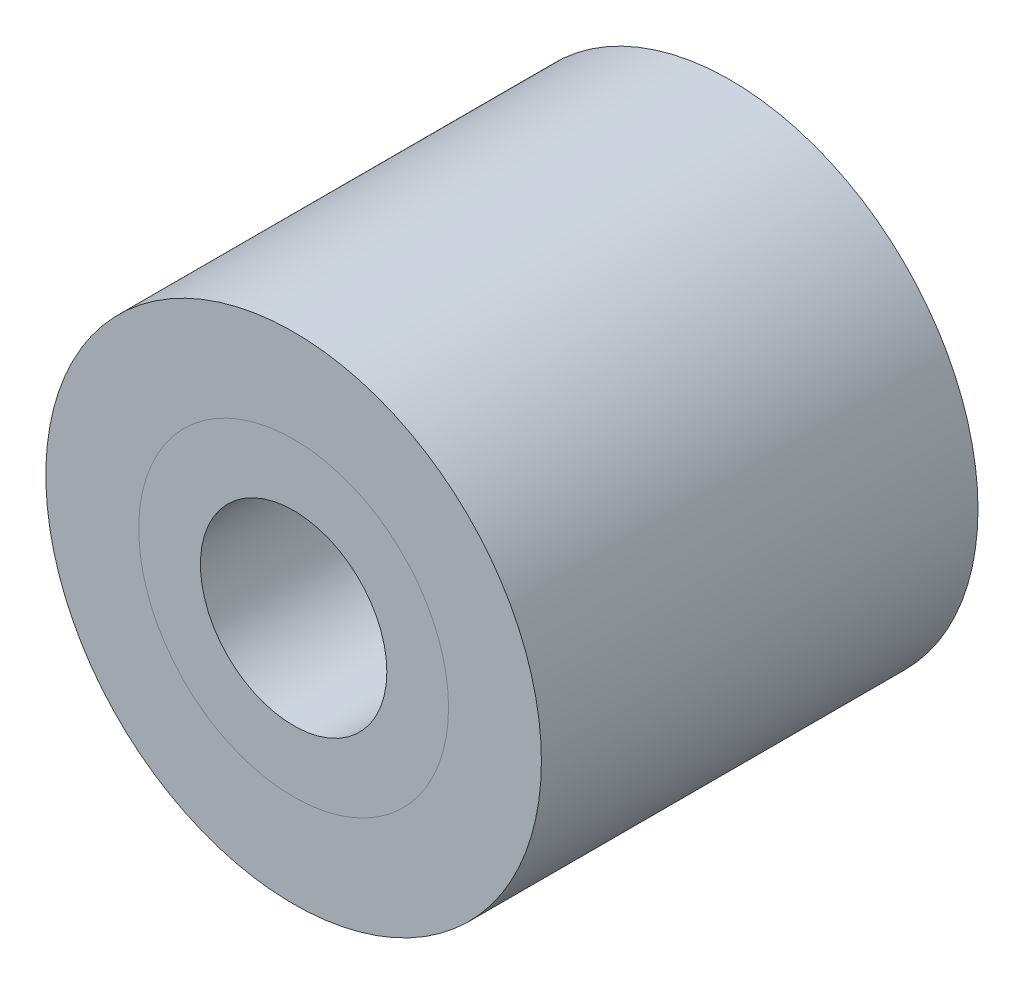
from build123d import *

# Parameters (mm, degrees)
SKETCH_1_R                     = 21
EXTRUDE_1_DEPTH                = 37
SKETCH_2_R                     = 7.9
CUT_EXTRUDE_1_DEPTH            = 48.444704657
SPLIT_BODIES_1_SURFACE_1_BACK  = 70.979
SPLIT_BODIES_1_SURFACE_1_DEPTH = 141.958
SPLIT_BODIES_1_SURFACE_2_BACK  = 70.979
SPLIT_BODIES_1_SURFACE_2_DEPTH = 141.958
SKETCH_6_R                     = 2
CUT_EXTRUDE_2_DEPTH            = 48.444704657


with BuildPart() as part:
    # Sketch 1 → Extrude 1 (new body)
    with BuildSketch(Plane.XY):
        Circle(SKETCH_1_R)
    extrude(amount=-EXTRUDE_1_DEPTH)

    # Sketch 2 → Cut-Extrude 1 (cut, through all)
    with BuildSketch(Plane.XY):
        Circle(SKETCH_2_R)
    extrude(amount=-CUT_EXTRUDE_1_DEPTH, mode=Mode.SUBTRACT)


with BuildPart() as body_2:
    # Split Bodies 1: the piece behind the surface
    add(part.part)
    # Split Bodies 1 surface: a surface, the sketch's curves swept straight by 141.958 mm
    with BuildLine(Plane.XY.offset(-SPLIT_BODIES_1_SURFACE_1_BACK), mode=Mode.PRIVATE) as split_bodies_1_surface_1_path:
        CenterArc((0, 0), 13.13, 0, 360)
    split_bodies_1_surface_1 = Shell.extrude(split_bodies_1_surface_1_path.wire(), (0 * SPLIT_BODIES_1_SURFACE_1_DEPTH, 0 * SPLIT_BODIES_1_SURFACE_1_DEPTH, 1 * SPLIT_BODIES_1_SURFACE_1_DEPTH))
    split(bisect_by=split_bodies_1_surface_1, keep=Keep.BOTTOM)


with BuildPart() as part_1:
    add(part.part)

    # Split Bodies 1: split by a surface, the side it looks to stays
    # Split Bodies 1 surface: a surface, the sketch's curves swept straight by 141.958 mm
    with BuildLine(Plane.XY.offset(-SPLIT_BODIES_1_SURFACE_2_BACK), mode=Mode.PRIVATE) as split_bodies_1_surface_2_path:
        CenterArc((0, 0), 13.13, 0, 360)
    split_bodies_1_surface_2 = Shell.extrude(split_bodies_1_surface_2_path.wire(), (0 * SPLIT_BODIES_1_SURFACE_2_DEPTH, 0 * SPLIT_BODIES_1_SURFACE_2_DEPTH, 1 * SPLIT_BODIES_1_SURFACE_2_DEPTH))
    split(bisect_by=split_bodies_1_surface_2, keep=Keep.TOP)

    # Sketch 6 → Cut-Extrude 2 (cut, through all)
    with BuildSketch(Plane(origin=(0, 0, 0), x_dir=(1, 0, 0), z_dir=(0, 1, 0))):
        with Locations(Location((0, 18.5, 0), (0, 0, 90))):
            Circle(SKETCH_6_R)
    extrude(amount=CUT_EXTRUDE_2_DEPTH, mode=Mode.SUBTRACT)


solid = Compound([body_2.part, part_1.part])
